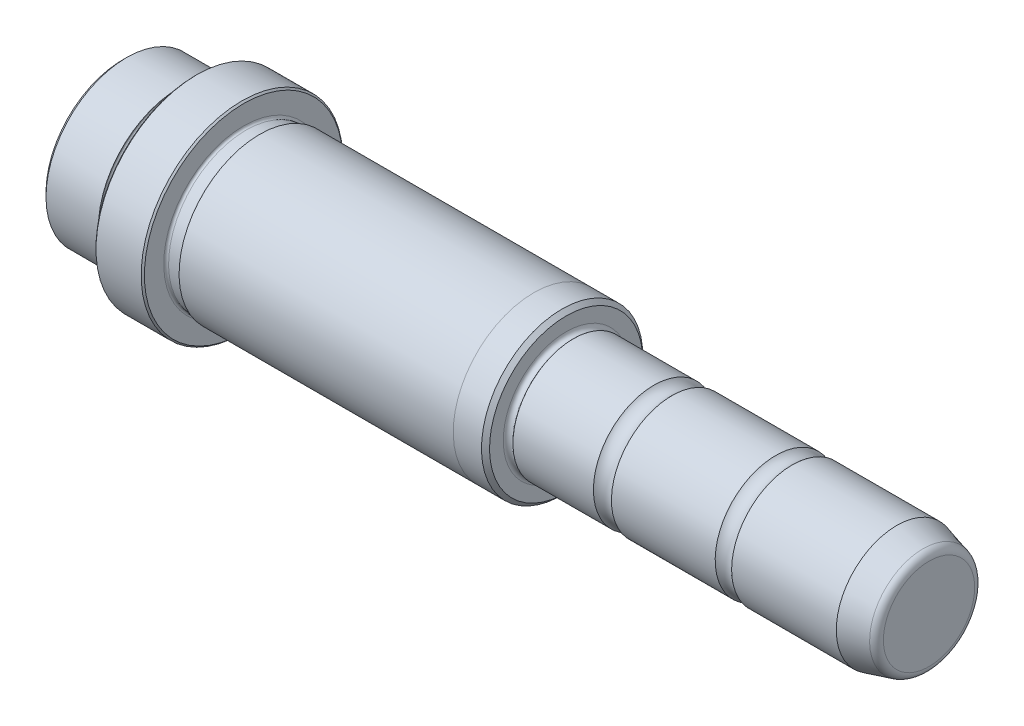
ISO-10303-21;
HEADER;
FILE_DESCRIPTION(('STEP AP214'),'2;1');
FILE_NAME('part.step','',(''),(''),'','','');
FILE_SCHEMA(('AUTOMOTIVE_DESIGN { 1 0 10303 214 1 1 1 1 }'));
ENDSEC;
DATA;
#1=APPLICATION_CONTEXT('core data for automotive mechanical design processes');
#2=APPLICATION_PROTOCOL_DEFINITION('international standard','automotive_design',2000,#1);
#3=PRODUCT_CONTEXT('',#1,'mechanical');
#4=PRODUCT('Part','Part','',(#3));
#5=PRODUCT_RELATED_PRODUCT_CATEGORY('part','',(#4));
#6=PRODUCT_DEFINITION_FORMATION('','',#4);
#7=PRODUCT_DEFINITION_CONTEXT('part definition',#1,'design');
#8=PRODUCT_DEFINITION('design','',#6,#7);
#9=PRODUCT_DEFINITION_SHAPE('','',#8);
#10=(LENGTH_UNIT() NAMED_UNIT(*) SI_UNIT(.MILLI.,.METRE.));
#11=(NAMED_UNIT(*) PLANE_ANGLE_UNIT() SI_UNIT($,.RADIAN.));
#12=(NAMED_UNIT(*) SI_UNIT($,.STERADIAN.) SOLID_ANGLE_UNIT());
#13=UNCERTAINTY_MEASURE_WITH_UNIT(LENGTH_MEASURE(1.E-05),#10,'distance_accuracy_value','');
#14=(GEOMETRIC_REPRESENTATION_CONTEXT(3) GLOBAL_UNCERTAINTY_ASSIGNED_CONTEXT((#13)) GLOBAL_UNIT_ASSIGNED_CONTEXT((#10,
#11,#12)) REPRESENTATION_CONTEXT('',''));
#15=CARTESIAN_POINT('',(0.,0.,0.));
#16=DIRECTION('',(0.,0.,1.));
#17=DIRECTION('',(1.,0.,0.));
#18=AXIS2_PLACEMENT_3D('',#15,#16,#17);
#19=CARTESIAN_POINT('',(45.,0.,0.));
#20=DIRECTION('',(1.,0.,0.));
#21=DIRECTION('',(0.,1.,0.));
#22=AXIS2_PLACEMENT_3D('',#19,#20,#21);
#23=CYLINDRICAL_SURFACE('',#22,7.49999999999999);
#24=CARTESIAN_POINT('',(0.899999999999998,0.,0.));
#25=DIRECTION('',(1.,0.,0.));
#26=DIRECTION('',(0.,1.,0.));
#27=AXIS2_PLACEMENT_3D('',#24,#25,#26);
#28=CIRCLE('',#27,7.49999999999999);
#29=CARTESIAN_POINT('',(0.899999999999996,7.5,0.));
#30=VERTEX_POINT('',#29);
#31=EDGE_CURVE('E105',#30,#30,#28,.T.);
#32=ORIENTED_EDGE('',*,*,#31,.T.);
#33=EDGE_LOOP('',(#32));
#34=FACE_BOUND('',#33,.T.);
#35=CARTESIAN_POINT('',(10.8819660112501,0.,0.));
#36=DIRECTION('',(-1.,0.,0.));
#37=DIRECTION('',(0.,-1.,0.));
#38=AXIS2_PLACEMENT_3D('',#35,#36,#37);
#39=CIRCLE('',#38,7.49999999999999);
#40=CARTESIAN_POINT('',(10.8819660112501,-7.49999999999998,0.));
#41=VERTEX_POINT('',#40);
#42=EDGE_CURVE('E120',#41,#41,#39,.T.);
#43=ORIENTED_EDGE('',*,*,#42,.T.);
#44=EDGE_LOOP('',(#43));
#45=FACE_BOUND('',#44,.T.);
#46=ADVANCED_FACE('F28',(#34,#45),#23,.T.);
#47=CARTESIAN_POINT('',(-55.,9.99999999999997,0.));
#48=DIRECTION('',(-1.,0.,0.));
#49=DIRECTION('',(0.,-1.,0.));
#50=AXIS2_PLACEMENT_3D('',#47,#48,#49);
#51=PLANE('',#50);
#52=CARTESIAN_POINT('',(-55.,0.,0.));
#53=DIRECTION('',(-1.,0.,0.));
#54=DIRECTION('',(0.,-1.,0.));
#55=AXIS2_PLACEMENT_3D('',#52,#53,#54);
#56=CIRCLE('',#55,9.50000000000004);
#57=CARTESIAN_POINT('',(-55.,-9.50000000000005,0.));
#58=VERTEX_POINT('',#57);
#59=EDGE_CURVE('E39',#58,#58,#56,.T.);
#60=ORIENTED_EDGE('',*,*,#59,.T.);
#61=EDGE_LOOP('',(#60));
#62=FACE_BOUND('',#61,.T.);
#63=ADVANCED_FACE('F143',(#62),#51,.T.);
#64=CARTESIAN_POINT('',(45.,0.,0.));
#65=DIRECTION('',(1.,0.,0.));
#66=DIRECTION('',(0.,1.,0.));
#67=AXIS2_PLACEMENT_3D('',#64,#65,#66);
#68=CYLINDRICAL_SURFACE('',#67,9.99999999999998);
#69=CARTESIAN_POINT('',(-54.5,0.,0.));
#70=DIRECTION('',(-1.,0.,0.));
#71=DIRECTION('',(0.,-1.,0.));
#72=AXIS2_PLACEMENT_3D('',#69,#70,#71);
#73=CIRCLE('',#72,9.99999999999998);
#74=CARTESIAN_POINT('',(-54.5,-10.,0.));
#75=VERTEX_POINT('',#74);
#76=EDGE_CURVE('E43',#75,#75,#73,.F.);
#77=ORIENTED_EDGE('',*,*,#76,.T.);
#78=EDGE_LOOP('',(#77));
#79=FACE_BOUND('',#78,.T.);
#80=CARTESIAN_POINT('',(-48.,0.,0.));
#81=DIRECTION('',(1.,0.,0.));
#82=DIRECTION('',(0.,1.,0.));
#83=AXIS2_PLACEMENT_3D('',#80,#81,#82);
#84=CIRCLE('',#83,9.99999999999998);
#85=CARTESIAN_POINT('',(-48.,9.99999999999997,0.));
#86=VERTEX_POINT('',#85);
#87=EDGE_CURVE('E66',#86,#86,#84,.T.);
#88=ORIENTED_EDGE('',*,*,#87,.F.);
#89=EDGE_LOOP('',(#88));
#90=FACE_BOUND('',#89,.T.);
#91=ADVANCED_FACE('F151',(#79,#90),#68,.T.);
#92=CARTESIAN_POINT('',(-48.,9.89999999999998,0.));
#93=DIRECTION('',(1.,0.,0.));
#94=DIRECTION('',(0.,1.,0.));
#95=AXIS2_PLACEMENT_3D('',#92,#93,#94);
#96=PLANE('',#95);
#97=ORIENTED_EDGE('',*,*,#87,.T.);
#98=EDGE_LOOP('',(#97));
#99=FACE_BOUND('',#98,.T.);
#100=CARTESIAN_POINT('',(-48.,0.,0.));
#101=DIRECTION('',(1.,0.,0.));
#102=DIRECTION('',(0.,1.,0.));
#103=AXIS2_PLACEMENT_3D('',#100,#101,#102);
#104=CIRCLE('',#103,9.89999999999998);
#105=CARTESIAN_POINT('',(-48.,9.89999999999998,0.));
#106=VERTEX_POINT('',#105);
#107=EDGE_CURVE('E69',#106,#106,#104,.T.);
#108=ORIENTED_EDGE('',*,*,#107,.F.);
#109=EDGE_LOOP('',(#108));
#110=FACE_BOUND('',#109,.T.);
#111=ADVANCED_FACE('F206',(#99,#110),#96,.T.);
#112=CARTESIAN_POINT('',(-47.7,0.,0.));
#113=DIRECTION('',(1.,0.,0.));
#114=DIRECTION('',(0.,1.,0.));
#115=AXIS2_PLACEMENT_3D('',#112,#113,#114);
#116=TOROIDAL_SURFACE('',#115,9.89999999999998,0.299999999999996);
#117=ORIENTED_EDGE('',*,*,#107,.T.);
#118=EDGE_LOOP('',(#117));
#119=FACE_BOUND('',#118,.T.);
#120=CARTESIAN_POINT('',(-47.7,0.,0.));
#121=DIRECTION('',(1.,0.,0.));
#122=DIRECTION('',(0.,1.,0.));
#123=AXIS2_PLACEMENT_3D('',#120,#121,#122);
#124=CIRCLE('',#123,9.59999999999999);
#125=CARTESIAN_POINT('',(-47.7,9.59999999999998,0.));
#126=VERTEX_POINT('',#125);
#127=EDGE_CURVE('E72',#126,#126,#124,.T.);
#128=ORIENTED_EDGE('',*,*,#127,.F.);
#129=EDGE_LOOP('',(#128));
#130=FACE_BOUND('',#129,.T.);
#131=ADVANCED_FACE('F212',(#119,#130),#116,.F.);
#132=CARTESIAN_POINT('',(45.,0.,0.));
#133=DIRECTION('',(1.,0.,0.));
#134=DIRECTION('',(0.,1.,0.));
#135=AXIS2_PLACEMENT_3D('',#132,#133,#134);
#136=CYLINDRICAL_SURFACE('',#135,9.59999999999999);
#137=ORIENTED_EDGE('',*,*,#127,.T.);
#138=EDGE_LOOP('',(#137));
#139=FACE_BOUND('',#138,.T.);
#140=CARTESIAN_POINT('',(-46.3,0.,0.));
#141=DIRECTION('',(1.,0.,0.));
#142=DIRECTION('',(0.,1.,0.));
#143=AXIS2_PLACEMENT_3D('',#140,#141,#142);
#144=CIRCLE('',#143,9.59999999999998);
#145=CARTESIAN_POINT('',(-46.3,9.59999999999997,0.));
#146=VERTEX_POINT('',#145);
#147=EDGE_CURVE('E75',#146,#146,#144,.T.);
#148=ORIENTED_EDGE('',*,*,#147,.F.);
#149=EDGE_LOOP('',(#148));
#150=FACE_BOUND('',#149,.T.);
#151=ADVANCED_FACE('F218',(#139,#150),#136,.T.);
#152=CARTESIAN_POINT('',(-46.3,0.,0.));
#153=DIRECTION('',(1.,0.,0.));
#154=DIRECTION('',(0.,1.,0.));
#155=AXIS2_PLACEMENT_3D('',#152,#153,#154);
#156=TOROIDAL_SURFACE('',#155,9.89999999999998,0.300000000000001);
#157=ORIENTED_EDGE('',*,*,#147,.T.);
#158=EDGE_LOOP('',(#157));
#159=FACE_BOUND('',#158,.T.);
#160=CARTESIAN_POINT('',(-46.,0.,0.));
#161=DIRECTION('',(1.,0.,0.));
#162=DIRECTION('',(0.,1.,0.));
#163=AXIS2_PLACEMENT_3D('',#160,#161,#162);
#164=CIRCLE('',#163,9.89999999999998);
#165=CARTESIAN_POINT('',(-46.,9.89999999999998,0.));
#166=VERTEX_POINT('',#165);
#167=EDGE_CURVE('E78',#166,#166,#164,.T.);
#168=ORIENTED_EDGE('',*,*,#167,.F.);
#169=EDGE_LOOP('',(#168));
#170=FACE_BOUND('',#169,.T.);
#171=ADVANCED_FACE('F224',(#159,#170),#156,.F.);
#172=CARTESIAN_POINT('',(-46.,12.5,0.));
#173=DIRECTION('',(-1.,0.,0.));
#174=DIRECTION('',(0.,-1.,0.));
#175=AXIS2_PLACEMENT_3D('',#172,#173,#174);
#176=PLANE('',#175);
#177=CARTESIAN_POINT('',(-46.,0.,0.));
#178=DIRECTION('',(-1.,0.,0.));
#179=DIRECTION('',(0.,-1.,0.));
#180=AXIS2_PLACEMENT_3D('',#177,#178,#179);
#181=CIRCLE('',#180,12.3);
#182=CARTESIAN_POINT('',(-46.,12.3,0.));
#183=VERTEX_POINT('',#182);
#184=EDGE_CURVE('E51',#183,#183,#181,.T.);
#185=ORIENTED_EDGE('',*,*,#184,.T.);
#186=EDGE_LOOP('',(#185));
#187=FACE_BOUND('',#186,.T.);
#188=ORIENTED_EDGE('',*,*,#167,.T.);
#189=EDGE_LOOP('',(#188));
#190=FACE_BOUND('',#189,.T.);
#191=ADVANCED_FACE('F230',(#187,#190),#176,.T.);
#192=CARTESIAN_POINT('',(45.,0.,0.));
#193=DIRECTION('',(1.,0.,0.));
#194=DIRECTION('',(0.,1.,0.));
#195=AXIS2_PLACEMENT_3D('',#192,#193,#194);
#196=CYLINDRICAL_SURFACE('',#195,12.5);
#197=CARTESIAN_POINT('',(-45.8,0.,0.));
#198=DIRECTION('',(-1.,0.,0.));
#199=DIRECTION('',(0.,-1.,0.));
#200=AXIS2_PLACEMENT_3D('',#197,#198,#199);
#201=CIRCLE('',#200,12.5);
#202=CARTESIAN_POINT('',(-45.8,12.5,0.));
#203=VERTEX_POINT('',#202);
#204=EDGE_CURVE('E54',#203,#203,#201,.F.);
#205=CARTESIAN_POINT('',(-40.2,0.,0.));
#206=DIRECTION('',(1.,0.,0.));
#207=DIRECTION('',(0.,1.,0.));
#208=AXIS2_PLACEMENT_3D('',#205,#206,#207);
#209=CIRCLE('',#208,12.5);
#210=CARTESIAN_POINT('',(-40.2,12.5,0.));
#211=VERTEX_POINT('',#210);
#212=EDGE_CURVE('E57',#211,#211,#209,.F.);
#213=CARTESIAN_POINT('',(-45.8,12.5,0.));
#214=CARTESIAN_POINT('',(-45.7416666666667,12.5,0.));
#215=CARTESIAN_POINT('',(-45.6833333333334,12.5,0.));
#216=CARTESIAN_POINT('',(-45.5666666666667,12.5,0.));
#217=CARTESIAN_POINT('',(-45.5083333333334,12.5,0.));
#218=CARTESIAN_POINT('',(-45.3916666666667,12.5,0.));
#219=CARTESIAN_POINT('',(-45.3333333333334,12.5,0.));
#220=CARTESIAN_POINT('',(-45.2166666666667,12.5,0.));
#221=CARTESIAN_POINT('',(-45.1583333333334,12.5,0.));
#222=CARTESIAN_POINT('',(-45.0416666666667,12.5,0.));
#223=CARTESIAN_POINT('',(-44.9833333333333,12.5,0.));
#224=CARTESIAN_POINT('',(-44.8666666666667,12.5,0.));
#225=CARTESIAN_POINT('',(-44.8083333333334,12.5,0.));
#226=CARTESIAN_POINT('',(-44.6916666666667,12.5,0.));
#227=CARTESIAN_POINT('',(-44.6333333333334,12.5,0.));
#228=CARTESIAN_POINT('',(-44.5166666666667,12.5,0.));
#229=CARTESIAN_POINT('',(-44.4583333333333,12.5,0.));
#230=CARTESIAN_POINT('',(-44.3416666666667,12.5,0.));
#231=CARTESIAN_POINT('',(-44.2833333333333,12.5,0.));
#232=CARTESIAN_POINT('',(-44.1666666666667,12.5,0.));
#233=CARTESIAN_POINT('',(-44.1083333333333,12.5,0.));
#234=CARTESIAN_POINT('',(-43.9916666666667,12.5,0.));
#235=CARTESIAN_POINT('',(-43.9333333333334,12.5,0.));
#236=CARTESIAN_POINT('',(-43.8166666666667,12.5,0.));
#237=CARTESIAN_POINT('',(-43.7583333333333,12.5,0.));
#238=CARTESIAN_POINT('',(-43.6416666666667,12.5,0.));
#239=CARTESIAN_POINT('',(-43.5833333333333,12.5,0.));
#240=CARTESIAN_POINT('',(-43.4666666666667,12.5,0.));
#241=CARTESIAN_POINT('',(-43.4083333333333,12.5,0.));
#242=CARTESIAN_POINT('',(-43.2916666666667,12.5,0.));
#243=CARTESIAN_POINT('',(-43.2333333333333,12.5,0.));
#244=CARTESIAN_POINT('',(-43.1166666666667,12.5,0.));
#245=CARTESIAN_POINT('',(-43.0583333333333,12.5,0.));
#246=CARTESIAN_POINT('',(-42.9416666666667,12.5,0.));
#247=CARTESIAN_POINT('',(-42.8833333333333,12.5,0.));
#248=CARTESIAN_POINT('',(-42.7666666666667,12.5,0.));
#249=CARTESIAN_POINT('',(-42.7083333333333,12.5,0.));
#250=CARTESIAN_POINT('',(-42.5916666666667,12.5,0.));
#251=CARTESIAN_POINT('',(-42.5333333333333,12.5,0.));
#252=CARTESIAN_POINT('',(-42.4166666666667,12.5,0.));
#253=CARTESIAN_POINT('',(-42.3583333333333,12.5,0.));
#254=CARTESIAN_POINT('',(-42.2416666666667,12.5,0.));
#255=CARTESIAN_POINT('',(-42.1833333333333,12.5,0.));
#256=CARTESIAN_POINT('',(-42.0666666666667,12.5,0.));
#257=CARTESIAN_POINT('',(-42.0083333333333,12.5,0.));
#258=CARTESIAN_POINT('',(-41.8916666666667,12.5,0.));
#259=CARTESIAN_POINT('',(-41.8333333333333,12.5,0.));
#260=CARTESIAN_POINT('',(-41.7166666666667,12.5,0.));
#261=CARTESIAN_POINT('',(-41.6583333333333,12.5,0.));
#262=CARTESIAN_POINT('',(-41.5416666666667,12.5,0.));
#263=CARTESIAN_POINT('',(-41.4833333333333,12.5,0.));
#264=CARTESIAN_POINT('',(-41.3666666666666,12.5,0.));
#265=CARTESIAN_POINT('',(-41.3083333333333,12.5,0.));
#266=CARTESIAN_POINT('',(-41.1916666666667,12.5,0.));
#267=CARTESIAN_POINT('',(-41.1333333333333,12.5,0.));
#268=CARTESIAN_POINT('',(-41.0166666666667,12.5,0.));
#269=CARTESIAN_POINT('',(-40.9583333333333,12.5,0.));
#270=CARTESIAN_POINT('',(-40.8416666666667,12.5,0.));
#271=CARTESIAN_POINT('',(-40.7833333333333,12.5,0.));
#272=CARTESIAN_POINT('',(-40.6666666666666,12.5,0.));
#273=CARTESIAN_POINT('',(-40.6083333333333,12.5,0.));
#274=CARTESIAN_POINT('',(-40.4916666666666,12.5,0.));
#275=CARTESIAN_POINT('',(-40.4333333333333,12.5,0.));
#276=CARTESIAN_POINT('',(-40.3166666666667,12.5,0.));
#277=CARTESIAN_POINT('',(-40.2583333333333,12.5,0.));
#278=CARTESIAN_POINT('',(-40.2,12.5,0.));
#279=B_SPLINE_CURVE_WITH_KNOTS('',3,(#213,#214,#215,#216,#217,#218,#219,#220,#221,#222,#223,
#224,#225,#226,#227,#228,#229,#230,#231,#232,#233,#234,#235,#236,#237,#238,#239,#240,#241,#242,
#243,#244,#245,#246,#247,#248,#249,#250,#251,#252,#253,#254,#255,#256,#257,#258,#259,#260,#261,
#262,#263,#264,#265,#266,#267,#268,#269,#270,#271,#272,#273,#274,#275,#276,#277,#278),
.UNSPECIFIED.,.F.,.F.,(4,2,2,2,2,2,2,2,2,2,2,2,2,2,2,2,2,2,2,2,2,2,2,2,2,2,2,2,2,2,2,2,4),(0.,
0.175000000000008,0.350000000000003,0.524999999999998,0.700000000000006,0.875000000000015,
1.05000000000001,1.225,1.40000000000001,1.57500000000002,1.75000000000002,1.92500000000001,
2.10000000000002,2.27500000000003,2.45000000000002,2.62500000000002,2.80000000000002,
2.97500000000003,3.15000000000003,3.32500000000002,3.50000000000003,3.67500000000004,
3.85000000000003,4.02500000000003,4.20000000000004,4.37500000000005,4.55000000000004,
4.72500000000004,4.90000000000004,5.07500000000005,5.25000000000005,5.42500000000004,
5.60000000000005),.UNSPECIFIED.);
#280=EDGE_CURVE('BSEAM235',#203,#211,#279,.T.);
#281=ORIENTED_EDGE('',*,*,#204,.T.);
#282=ORIENTED_EDGE('',*,*,#212,.T.);
#283=ORIENTED_EDGE('',*,*,#280,.T.);
#284=ORIENTED_EDGE('',*,*,#280,.F.);
#285=EDGE_LOOP('',(#281,#283,#282,#284));
#286=FACE_BOUND('',#285,.T.);
#287=ADVANCED_FACE('F235',(#286),#196,.T.);
#288=CARTESIAN_POINT('',(-40.,9.89999999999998,0.));
#289=DIRECTION('',(1.,0.,0.));
#290=DIRECTION('',(0.,1.,0.));
#291=AXIS2_PLACEMENT_3D('',#288,#289,#290);
#292=PLANE('',#291);
#293=CARTESIAN_POINT('',(-40.,0.,0.));
#294=DIRECTION('',(1.,0.,0.));
#295=DIRECTION('',(0.,1.,0.));
#296=AXIS2_PLACEMENT_3D('',#293,#294,#295);
#297=CIRCLE('',#296,12.3);
#298=CARTESIAN_POINT('',(-40.,12.3,0.));
#299=VERTEX_POINT('',#298);
#300=EDGE_CURVE('E48',#299,#299,#297,.T.);
#301=ORIENTED_EDGE('',*,*,#300,.T.);
#302=EDGE_LOOP('',(#301));
#303=FACE_BOUND('',#302,.T.);
#304=CARTESIAN_POINT('',(-40.,0.,0.));
#305=DIRECTION('',(1.,0.,0.));
#306=DIRECTION('',(0.,1.,0.));
#307=AXIS2_PLACEMENT_3D('',#304,#305,#306);
#308=CIRCLE('',#307,9.89999999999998);
#309=CARTESIAN_POINT('',(-40.,9.89999999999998,0.));
#310=VERTEX_POINT('',#309);
#311=EDGE_CURVE('E81',#310,#310,#308,.T.);
#312=ORIENTED_EDGE('',*,*,#311,.F.);
#313=EDGE_LOOP('',(#312));
#314=FACE_BOUND('',#313,.T.);
#315=ADVANCED_FACE('F241',(#303,#314),#292,.T.);
#316=CARTESIAN_POINT('',(-39.7,0.,0.));
#317=DIRECTION('',(1.,0.,0.));
#318=DIRECTION('',(0.,1.,0.));
#319=AXIS2_PLACEMENT_3D('',#316,#317,#318);
#320=TOROIDAL_SURFACE('',#319,9.89999999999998,0.299999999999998);
#321=ORIENTED_EDGE('',*,*,#311,.T.);
#322=EDGE_LOOP('',(#321));
#323=FACE_BOUND('',#322,.T.);
#324=CARTESIAN_POINT('',(-39.7,0.,0.));
#325=DIRECTION('',(1.,0.,0.));
#326=DIRECTION('',(0.,1.,0.));
#327=AXIS2_PLACEMENT_3D('',#324,#325,#326);
#328=CIRCLE('',#327,9.59999999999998);
#329=CARTESIAN_POINT('',(-39.7,9.59999999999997,0.));
#330=VERTEX_POINT('',#329);
#331=EDGE_CURVE('E84',#330,#330,#328,.T.);
#332=ORIENTED_EDGE('',*,*,#331,.F.);
#333=EDGE_LOOP('',(#332));
#334=FACE_BOUND('',#333,.T.);
#335=ADVANCED_FACE('F247',(#323,#334),#320,.F.);
#336=CARTESIAN_POINT('',(45.,0.,0.));
#337=DIRECTION('',(1.,0.,0.));
#338=DIRECTION('',(0.,1.,0.));
#339=AXIS2_PLACEMENT_3D('',#336,#337,#338);
#340=CYLINDRICAL_SURFACE('',#339,9.59999999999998);
#341=ORIENTED_EDGE('',*,*,#331,.T.);
#342=EDGE_LOOP('',(#341));
#343=FACE_BOUND('',#342,.T.);
#344=CARTESIAN_POINT('',(-38.3,0.,0.));
#345=DIRECTION('',(1.,0.,0.));
#346=DIRECTION('',(0.,1.,0.));
#347=AXIS2_PLACEMENT_3D('',#344,#345,#346);
#348=CIRCLE('',#347,9.59999999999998);
#349=CARTESIAN_POINT('',(-38.3,9.59999999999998,0.));
#350=VERTEX_POINT('',#349);
#351=EDGE_CURVE('E87',#350,#350,#348,.T.);
#352=ORIENTED_EDGE('',*,*,#351,.F.);
#353=EDGE_LOOP('',(#352));
#354=FACE_BOUND('',#353,.T.);
#355=ADVANCED_FACE('F251',(#343,#354),#340,.T.);
#356=CARTESIAN_POINT('',(-38.3,0.,0.));
#357=DIRECTION('',(1.,0.,0.));
#358=DIRECTION('',(0.,1.,0.));
#359=AXIS2_PLACEMENT_3D('',#356,#357,#358);
#360=TOROIDAL_SURFACE('',#359,9.89999999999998,0.300000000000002);
#361=ORIENTED_EDGE('',*,*,#351,.T.);
#362=EDGE_LOOP('',(#361));
#363=FACE_BOUND('',#362,.T.);
#364=CARTESIAN_POINT('',(-38.,0.,0.));
#365=DIRECTION('',(1.,0.,0.));
#366=DIRECTION('',(0.,1.,0.));
#367=AXIS2_PLACEMENT_3D('',#364,#365,#366);
#368=CIRCLE('',#367,9.89999999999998);
#369=CARTESIAN_POINT('',(-38.,9.89999999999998,0.));
#370=VERTEX_POINT('',#369);
#371=EDGE_CURVE('E90',#370,#370,#368,.T.);
#372=ORIENTED_EDGE('',*,*,#371,.F.);
#373=EDGE_LOOP('',(#372));
#374=FACE_BOUND('',#373,.T.);
#375=ADVANCED_FACE('F255',(#363,#374),#360,.F.);
#376=CARTESIAN_POINT('',(-38.,10.0001,0.));
#377=DIRECTION('',(-1.,0.,0.));
#378=DIRECTION('',(0.,-1.,0.));
#379=AXIS2_PLACEMENT_3D('',#376,#377,#378);
#380=PLANE('',#379);
#381=ORIENTED_EDGE('',*,*,#371,.T.);
#382=EDGE_LOOP('',(#381));
#383=FACE_BOUND('',#382,.T.);
#384=CARTESIAN_POINT('',(-38.,0.,0.));
#385=DIRECTION('',(1.,0.,0.));
#386=DIRECTION('',(0.,1.,0.));
#387=AXIS2_PLACEMENT_3D('',#384,#385,#386);
#388=CIRCLE('',#387,10.0001);
#389=CARTESIAN_POINT('',(-38.,10.0001,0.));
#390=VERTEX_POINT('',#389);
#391=EDGE_CURVE('E93',#390,#390,#388,.T.);
#392=ORIENTED_EDGE('',*,*,#391,.F.);
#393=EDGE_LOOP('',(#392));
#394=FACE_BOUND('',#393,.T.);
#395=ADVANCED_FACE('F259',(#383,#394),#380,.T.);
#396=CARTESIAN_POINT('',(45.,0.,0.));
#397=DIRECTION('',(1.,0.,0.));
#398=DIRECTION('',(0.,1.,0.));
#399=AXIS2_PLACEMENT_3D('',#396,#397,#398);
#400=CYLINDRICAL_SURFACE('',#399,10.0001);
#401=ORIENTED_EDGE('',*,*,#391,.T.);
#402=EDGE_LOOP('',(#401));
#403=FACE_BOUND('',#402,.T.);
#404=CARTESIAN_POINT('',(-4.,0.,0.));
#405=DIRECTION('',(1.,0.,0.));
#406=DIRECTION('',(0.,1.,0.));
#407=AXIS2_PLACEMENT_3D('',#404,#405,#406);
#408=CIRCLE('',#407,10.0001);
#409=CARTESIAN_POINT('',(-4.00000000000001,10.0001,0.));
#410=VERTEX_POINT('',#409);
#411=EDGE_CURVE('E96',#410,#410,#408,.T.);
#412=ORIENTED_EDGE('',*,*,#411,.F.);
#413=EDGE_LOOP('',(#412));
#414=FACE_BOUND('',#413,.T.);
#415=ADVANCED_FACE('F263',(#403,#414),#400,.T.);
#416=CARTESIAN_POINT('',(-4.,10.0001,0.));
#417=DIRECTION('',(1.,0.,0.));
#418=DIRECTION('',(0.,1.,0.));
#419=AXIS2_PLACEMENT_3D('',#416,#417,#418);
#420=PLANE('',#419);
#421=ORIENTED_EDGE('',*,*,#411,.T.);
#422=EDGE_LOOP('',(#421));
#423=FACE_BOUND('',#422,.T.);
#424=CARTESIAN_POINT('',(-4.,0.,0.));
#425=DIRECTION('',(1.,0.,0.));
#426=DIRECTION('',(0.,1.,0.));
#427=AXIS2_PLACEMENT_3D('',#424,#425,#426);
#428=CIRCLE('',#427,9.99999999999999);
#429=CARTESIAN_POINT('',(-4.00000000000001,10.,0.));
#430=VERTEX_POINT('',#429);
#431=EDGE_CURVE('E99',#430,#430,#428,.T.);
#432=ORIENTED_EDGE('',*,*,#431,.F.);
#433=EDGE_LOOP('',(#432));
#434=FACE_BOUND('',#433,.T.);
#435=ADVANCED_FACE('F267',(#423,#434),#420,.T.);
#436=CARTESIAN_POINT('',(45.,0.,0.));
#437=DIRECTION('',(1.,0.,0.));
#438=DIRECTION('',(0.,1.,0.));
#439=AXIS2_PLACEMENT_3D('',#436,#437,#438);
#440=CYLINDRICAL_SURFACE('',#439,9.99999999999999);
#441=CARTESIAN_POINT('',(-0.500000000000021,0.,0.));
#442=DIRECTION('',(1.,0.,0.));
#443=DIRECTION('',(0.,1.,0.));
#444=AXIS2_PLACEMENT_3D('',#441,#442,#443);
#445=CIRCLE('',#444,9.99999999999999);
#446=CARTESIAN_POINT('',(-0.500000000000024,9.99999999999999,0.));
#447=VERTEX_POINT('',#446);
#448=EDGE_CURVE('E10',#447,#447,#445,.F.);
#449=ORIENTED_EDGE('',*,*,#448,.T.);
#450=EDGE_LOOP('',(#449));
#451=FACE_BOUND('',#450,.T.);
#452=ORIENTED_EDGE('',*,*,#431,.T.);
#453=EDGE_LOOP('',(#452));
#454=FACE_BOUND('',#453,.T.);
#455=ADVANCED_FACE('F271',(#451,#454),#440,.T.);
#456=CARTESIAN_POINT('',(0.,7.79999999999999,0.));
#457=DIRECTION('',(1.,0.,0.));
#458=DIRECTION('',(0.,1.,0.));
#459=AXIS2_PLACEMENT_3D('',#456,#457,#458);
#460=PLANE('',#459);
#461=CARTESIAN_POINT('',(0.,0.,0.));
#462=DIRECTION('',(1.,0.,0.));
#463=DIRECTION('',(0.,1.,0.));
#464=AXIS2_PLACEMENT_3D('',#461,#462,#463);
#465=CIRCLE('',#464,9.49999999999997);
#466=CARTESIAN_POINT('',(0.,9.49999999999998,0.));
#467=VERTEX_POINT('',#466);
#468=EDGE_CURVE('E35',#467,#467,#465,.T.);
#469=ORIENTED_EDGE('',*,*,#468,.T.);
#470=EDGE_LOOP('',(#469));
#471=FACE_BOUND('',#470,.T.);
#472=CARTESIAN_POINT('',(0.,0.,0.));
#473=DIRECTION('',(1.,0.,0.));
#474=DIRECTION('',(0.,1.,0.));
#475=AXIS2_PLACEMENT_3D('',#472,#473,#474);
#476=CIRCLE('',#475,7.79999999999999);
#477=CARTESIAN_POINT('',(0.,7.8,0.));
#478=VERTEX_POINT('',#477);
#479=EDGE_CURVE('E102',#478,#478,#476,.T.);
#480=ORIENTED_EDGE('',*,*,#479,.F.);
#481=EDGE_LOOP('',(#480));
#482=FACE_BOUND('',#481,.T.);
#483=ADVANCED_FACE('F138',(#471,#482),#460,.T.);
#484=CARTESIAN_POINT('',(0.5,0.,0.));
#485=DIRECTION('',(1.,0.,0.));
#486=DIRECTION('',(0.,1.,0.));
#487=AXIS2_PLACEMENT_3D('',#484,#485,#486);
#488=TOROIDAL_SURFACE('',#487,7.79999999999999,0.5);
#489=ORIENTED_EDGE('',*,*,#479,.T.);
#490=EDGE_LOOP('',(#489));
#491=FACE_BOUND('',#490,.T.);
#492=ORIENTED_EDGE('',*,*,#31,.F.);
#493=EDGE_LOOP('',(#492));
#494=FACE_BOUND('',#493,.T.);
#495=ADVANCED_FACE('F128',(#491,#494),#488,.F.);
#496=CARTESIAN_POINT('',(12.,0.,0.));
#497=DIRECTION('',(-1.,0.,0.));
#498=DIRECTION('',(0.,-1.,0.));
#499=AXIS2_PLACEMENT_3D('',#496,#497,#498);
#500=TOROIDAL_SURFACE('',#499,8.49999999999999,1.5);
#501=CARTESIAN_POINT('',(13.1180339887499,0.,0.));
#502=DIRECTION('',(-1.,0.,0.));
#503=DIRECTION('',(0.,-1.,0.));
#504=AXIS2_PLACEMENT_3D('',#501,#502,#503);
#505=CIRCLE('',#504,7.49999999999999);
#506=CARTESIAN_POINT('',(13.1180339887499,-7.49999999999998,0.));
#507=VERTEX_POINT('',#506);
#508=EDGE_CURVE('E117',#507,#507,#505,.T.);
#509=ORIENTED_EDGE('',*,*,#508,.T.);
#510=EDGE_LOOP('',(#509));
#511=FACE_BOUND('',#510,.T.);
#512=ORIENTED_EDGE('',*,*,#42,.F.);
#513=EDGE_LOOP('',(#512));
#514=FACE_BOUND('',#513,.T.);
#515=ADVANCED_FACE('F125',(#511,#514),#500,.F.);
#516=CARTESIAN_POINT('',(45.,6.42820323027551,0.));
#517=DIRECTION('',(1.,0.,0.));
#518=DIRECTION('',(0.,1.,0.));
#519=AXIS2_PLACEMENT_3D('',#516,#517,#518);
#520=PLANE('',#519);
#521=CARTESIAN_POINT('',(45.,0.,0.));
#522=DIRECTION('',(1.,0.,0.));
#523=DIRECTION('',(0.,1.,0.));
#524=AXIS2_PLACEMENT_3D('',#521,#522,#523);
#525=CIRCLE('',#524,5.66087624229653);
#526=CARTESIAN_POINT('',(45.,5.66087624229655,0.));
#527=VERTEX_POINT('',#526);
#528=EDGE_CURVE('E63',#527,#527,#525,.T.);
#529=ORIENTED_EDGE('',*,*,#528,.T.);
#530=EDGE_LOOP('',(#529));
#531=FACE_BOUND('',#530,.T.);
#532=ADVANCED_FACE('F127',(#531),#520,.T.);
#533=CARTESIAN_POINT('',(45.,0.,0.));
#534=DIRECTION('',(-1.,0.,0.));
#535=DIRECTION('',(0.,-1.,0.));
#536=AXIS2_PLACEMENT_3D('',#533,#534,#535);
#537=CONICAL_SURFACE('',#536,6.42820323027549,0.26179938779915);
#538=CARTESIAN_POINT('',(44.2588190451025,0.,0.));
#539=DIRECTION('',(1.,0.,0.));
#540=DIRECTION('',(0.,1.,0.));
#541=AXIS2_PLACEMENT_3D('',#538,#539,#540);
#542=CIRCLE('',#541,6.6268020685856);
#543=CARTESIAN_POINT('',(44.2588190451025,6.62680206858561,0.));
#544=VERTEX_POINT('',#543);
#545=EDGE_CURVE('E60',#544,#544,#542,.F.);
#546=ORIENTED_EDGE('',*,*,#545,.T.);
#547=EDGE_LOOP('',(#546));
#548=FACE_BOUND('',#547,.T.);
#549=CARTESIAN_POINT('',(41.,0.,0.));
#550=DIRECTION('',(1.,0.,0.));
#551=DIRECTION('',(0.,1.,0.));
#552=AXIS2_PLACEMENT_3D('',#549,#550,#551);
#553=CIRCLE('',#552,7.49999999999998);
#554=CARTESIAN_POINT('',(41.,7.5,0.));
#555=VERTEX_POINT('',#554);
#556=EDGE_CURVE('E108',#555,#555,#553,.T.);
#557=ORIENTED_EDGE('',*,*,#556,.T.);
#558=EDGE_LOOP('',(#557));
#559=FACE_BOUND('',#558,.T.);
#560=ADVANCED_FACE('F135',(#548,#559),#537,.T.);
#561=ORIENTED_EDGE('',*,*,#556,.F.);
#562=EDGE_LOOP('',(#561));
#563=FACE_BOUND('',#562,.T.);
#564=CARTESIAN_POINT('',(28.0198039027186,0.,0.));
#565=DIRECTION('',(-1.,0.,0.));
#566=DIRECTION('',(0.,-1.,0.));
#567=AXIS2_PLACEMENT_3D('',#564,#565,#566);
#568=CIRCLE('',#567,7.49999999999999);
#569=CARTESIAN_POINT('',(28.0198039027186,-7.49999999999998,0.));
#570=VERTEX_POINT('',#569);
#571=EDGE_CURVE('E111',#570,#570,#568,.T.);
#572=ORIENTED_EDGE('',*,*,#571,.F.);
#573=EDGE_LOOP('',(#572));
#574=FACE_BOUND('',#573,.T.);
#575=ADVANCED_FACE('F147',(#563,#574),#23,.T.);
#576=CARTESIAN_POINT('',(27.,0.,0.));
#577=DIRECTION('',(-1.,0.,0.));
#578=DIRECTION('',(0.,-1.,0.));
#579=AXIS2_PLACEMENT_3D('',#576,#577,#578);
#580=TOROIDAL_SURFACE('',#579,8.59999999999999,1.5);
#581=ORIENTED_EDGE('',*,*,#571,.T.);
#582=EDGE_LOOP('',(#581));
#583=FACE_BOUND('',#582,.T.);
#584=CARTESIAN_POINT('',(25.9801960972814,0.,0.));
#585=DIRECTION('',(-1.,0.,0.));
#586=DIRECTION('',(0.,-1.,0.));
#587=AXIS2_PLACEMENT_3D('',#584,#585,#586);
#588=CIRCLE('',#587,7.49999999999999);
#589=CARTESIAN_POINT('',(25.9801960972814,-7.49999999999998,0.));
#590=VERTEX_POINT('',#589);
#591=EDGE_CURVE('E114',#590,#590,#588,.T.);
#592=ORIENTED_EDGE('',*,*,#591,.F.);
#593=EDGE_LOOP('',(#592));
#594=FACE_BOUND('',#593,.T.);
#595=ADVANCED_FACE('F157',(#583,#594),#580,.F.);
#596=ORIENTED_EDGE('',*,*,#591,.T.);
#597=EDGE_LOOP('',(#596));
#598=FACE_BOUND('',#597,.T.);
#599=ORIENTED_EDGE('',*,*,#508,.F.);
#600=EDGE_LOOP('',(#599));
#601=FACE_BOUND('',#600,.T.);
#602=ADVANCED_FACE('F146',(#598,#601),#23,.T.);
#603=CARTESIAN_POINT('',(44.,0.,0.));
#604=DIRECTION('',(1.,0.,0.));
#605=DIRECTION('',(0.,1.,0.));
#606=AXIS2_PLACEMENT_3D('',#603,#604,#605);
#607=TOROIDAL_SURFACE('',#606,5.66087624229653,1.);
#608=ORIENTED_EDGE('',*,*,#545,.F.);
#609=EDGE_LOOP('',(#608));
#610=FACE_BOUND('',#609,.T.);
#611=ORIENTED_EDGE('',*,*,#528,.F.);
#612=EDGE_LOOP('',(#611));
#613=FACE_BOUND('',#612,.T.);
#614=ADVANCED_FACE('F156',(#610,#613),#607,.T.);
#615=CARTESIAN_POINT('',(-45.8,0.,0.));
#616=DIRECTION('',(1.,0.,0.));
#617=DIRECTION('',(0.,1.,0.));
#618=AXIS2_PLACEMENT_3D('',#615,#616,#617);
#619=CONICAL_SURFACE('',#618,12.5,0.78539816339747);
#620=CARTESIAN_POINT('',(-46.,12.3,0.));
#621=CARTESIAN_POINT('',(-45.9979166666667,12.3020833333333,0.));
#622=CARTESIAN_POINT('',(-45.9958333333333,12.3041666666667,0.));
#623=CARTESIAN_POINT('',(-45.9916666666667,12.3083333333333,0.));
#624=CARTESIAN_POINT('',(-45.9895833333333,12.3104166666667,0.));
#625=CARTESIAN_POINT('',(-45.9854166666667,12.3145833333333,0.));
#626=CARTESIAN_POINT('',(-45.9833333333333,12.3166666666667,0.));
#627=CARTESIAN_POINT('',(-45.9791666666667,12.3208333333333,0.));
#628=CARTESIAN_POINT('',(-45.9770833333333,12.3229166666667,0.));
#629=CARTESIAN_POINT('',(-45.9729166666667,12.3270833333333,0.));
#630=CARTESIAN_POINT('',(-45.9708333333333,12.3291666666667,0.));
#631=CARTESIAN_POINT('',(-45.9666666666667,12.3333333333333,0.));
#632=CARTESIAN_POINT('',(-45.9645833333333,12.3354166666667,0.));
#633=CARTESIAN_POINT('',(-45.9604166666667,12.3395833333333,0.));
#634=CARTESIAN_POINT('',(-45.9583333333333,12.3416666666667,0.));
#635=CARTESIAN_POINT('',(-45.9541666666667,12.3458333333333,0.));
#636=CARTESIAN_POINT('',(-45.9520833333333,12.3479166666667,0.));
#637=CARTESIAN_POINT('',(-45.9479166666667,12.3520833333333,0.));
#638=CARTESIAN_POINT('',(-45.9458333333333,12.3541666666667,0.));
#639=CARTESIAN_POINT('',(-45.9416666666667,12.3583333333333,0.));
#640=CARTESIAN_POINT('',(-45.9395833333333,12.3604166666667,0.));
#641=CARTESIAN_POINT('',(-45.9354166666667,12.3645833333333,0.));
#642=CARTESIAN_POINT('',(-45.9333333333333,12.3666666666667,0.));
#643=CARTESIAN_POINT('',(-45.9291666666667,12.3708333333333,0.));
#644=CARTESIAN_POINT('',(-45.9270833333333,12.3729166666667,0.));
#645=CARTESIAN_POINT('',(-45.9229166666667,12.3770833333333,0.));
#646=CARTESIAN_POINT('',(-45.9208333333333,12.3791666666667,0.));
#647=CARTESIAN_POINT('',(-45.9166666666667,12.3833333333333,0.));
#648=CARTESIAN_POINT('',(-45.9145833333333,12.3854166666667,0.));
#649=CARTESIAN_POINT('',(-45.9104166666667,12.3895833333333,0.));
#650=CARTESIAN_POINT('',(-45.9083333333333,12.3916666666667,0.));
#651=CARTESIAN_POINT('',(-45.9041666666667,12.3958333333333,0.));
#652=CARTESIAN_POINT('',(-45.9020833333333,12.3979166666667,0.));
#653=CARTESIAN_POINT('',(-45.8979166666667,12.4020833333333,0.));
#654=CARTESIAN_POINT('',(-45.8958333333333,12.4041666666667,0.));
#655=CARTESIAN_POINT('',(-45.8916666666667,12.4083333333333,0.));
#656=CARTESIAN_POINT('',(-45.8895833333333,12.4104166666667,0.));
#657=CARTESIAN_POINT('',(-45.8854166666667,12.4145833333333,0.));
#658=CARTESIAN_POINT('',(-45.8833333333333,12.4166666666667,0.));
#659=CARTESIAN_POINT('',(-45.8791666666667,12.4208333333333,0.));
#660=CARTESIAN_POINT('',(-45.8770833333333,12.4229166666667,0.));
#661=CARTESIAN_POINT('',(-45.8729166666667,12.4270833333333,0.));
#662=CARTESIAN_POINT('',(-45.8708333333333,12.4291666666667,0.));
#663=CARTESIAN_POINT('',(-45.8666666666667,12.4333333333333,0.));
#664=CARTESIAN_POINT('',(-45.8645833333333,12.4354166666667,0.));
#665=CARTESIAN_POINT('',(-45.8604166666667,12.4395833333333,0.));
#666=CARTESIAN_POINT('',(-45.8583333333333,12.4416666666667,0.));
#667=CARTESIAN_POINT('',(-45.8541666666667,12.4458333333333,0.));
#668=CARTESIAN_POINT('',(-45.8520833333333,12.4479166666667,0.));
#669=CARTESIAN_POINT('',(-45.8479166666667,12.4520833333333,0.));
#670=CARTESIAN_POINT('',(-45.8458333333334,12.4541666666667,0.));
#671=CARTESIAN_POINT('',(-45.8416666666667,12.4583333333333,0.));
#672=CARTESIAN_POINT('',(-45.8395833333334,12.4604166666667,0.));
#673=CARTESIAN_POINT('',(-45.8354166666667,12.4645833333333,0.));
#674=CARTESIAN_POINT('',(-45.8333333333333,12.4666666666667,0.));
#675=CARTESIAN_POINT('',(-45.8291666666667,12.4708333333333,0.));
#676=CARTESIAN_POINT('',(-45.8270833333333,12.4729166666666,0.));
#677=CARTESIAN_POINT('',(-45.8229166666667,12.4770833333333,0.));
#678=CARTESIAN_POINT('',(-45.8208333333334,12.4791666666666,0.));
#679=CARTESIAN_POINT('',(-45.8166666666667,12.4833333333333,0.));
#680=CARTESIAN_POINT('',(-45.8145833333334,12.4854166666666,0.));
#681=CARTESIAN_POINT('',(-45.8104166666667,12.4895833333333,0.));
#682=CARTESIAN_POINT('',(-45.8083333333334,12.4916666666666,0.));
#683=CARTESIAN_POINT('',(-45.8041666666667,12.4958333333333,0.));
#684=CARTESIAN_POINT('',(-45.8020833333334,12.4979166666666,0.));
#685=CARTESIAN_POINT('',(-45.8,12.5,0.));
#686=B_SPLINE_CURVE_WITH_KNOTS('',3,(#620,#621,#622,#623,#624,#625,#626,#627,#628,#629,#630,
#631,#632,#633,#634,#635,#636,#637,#638,#639,#640,#641,#642,#643,#644,#645,#646,#647,#648,#649,
#650,#651,#652,#653,#654,#655,#656,#657,#658,#659,#660,#661,#662,#663,#664,#665,#666,#667,#668,
#669,#670,#671,#672,#673,#674,#675,#676,#677,#678,#679,#680,#681,#682,#683,#684,#685),
.UNSPECIFIED.,.F.,.F.,(4,2,2,2,2,2,2,2,2,2,2,2,2,2,2,2,2,2,2,2,2,2,2,2,2,2,2,2,2,2,2,2,4),(0.,
0.00883883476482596,0.0176776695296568,0.0265165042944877,0.0353553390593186,0.0441941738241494,
0.0530330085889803,0.0618718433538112,0.070710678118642,0.0795495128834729,0.0883883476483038,
0.0972271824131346,0.106066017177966,0.114904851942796,0.123743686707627,0.132582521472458,
0.14142135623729,0.150260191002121,0.159099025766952,0.167937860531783,0.176776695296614,
0.185615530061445,0.194454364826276,0.203293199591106,0.212132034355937,0.220970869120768,
0.229809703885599,0.23864853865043,0.247487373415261,0.256326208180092,0.265165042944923,
0.274003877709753,0.282842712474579),.UNSPECIFIED.);
#687=EDGE_CURVE('BSEAM181',#183,#203,#686,.T.);
#688=ORIENTED_EDGE('',*,*,#184,.F.);
#689=ORIENTED_EDGE('',*,*,#204,.F.);
#690=ORIENTED_EDGE('',*,*,#687,.T.);
#691=ORIENTED_EDGE('',*,*,#687,.F.);
#692=EDGE_LOOP('',(#688,#690,#689,#691));
#693=FACE_BOUND('',#692,.T.);
#694=ADVANCED_FACE('F181',(#693),#619,.T.);
#695=CARTESIAN_POINT('',(-40.,0.,0.));
#696=DIRECTION('',(-1.,0.,0.));
#697=DIRECTION('',(0.,-1.,0.));
#698=AXIS2_PLACEMENT_3D('',#695,#696,#697);
#699=CONICAL_SURFACE('',#698,12.3,0.785398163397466);
#700=ORIENTED_EDGE('',*,*,#212,.F.);
#701=EDGE_LOOP('',(#700));
#702=FACE_BOUND('',#701,.T.);
#703=ORIENTED_EDGE('',*,*,#300,.F.);
#704=EDGE_LOOP('',(#703));
#705=FACE_BOUND('',#704,.T.);
#706=ADVANCED_FACE('F187',(#702,#705),#699,.T.);
#707=CARTESIAN_POINT('',(-54.5,0.,0.));
#708=DIRECTION('',(1.,0.,0.));
#709=DIRECTION('',(0.,1.,0.));
#710=AXIS2_PLACEMENT_3D('',#707,#708,#709);
#711=CONICAL_SURFACE('',#710,9.99999999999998,0.785398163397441);
#712=ORIENTED_EDGE('',*,*,#59,.F.);
#713=EDGE_LOOP('',(#712));
#714=FACE_BOUND('',#713,.T.);
#715=ORIENTED_EDGE('',*,*,#76,.F.);
#716=EDGE_LOOP('',(#715));
#717=FACE_BOUND('',#716,.T.);
#718=ADVANCED_FACE('F192',(#714,#717),#711,.T.);
#719=CARTESIAN_POINT('',(0.,0.,0.));
#720=DIRECTION('',(-1.,0.,0.));
#721=DIRECTION('',(0.,-1.,0.));
#722=AXIS2_PLACEMENT_3D('',#719,#720,#721);
#723=CONICAL_SURFACE('',#722,9.49999999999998,0.785398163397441);
#724=ORIENTED_EDGE('',*,*,#448,.F.);
#725=EDGE_LOOP('',(#724));
#726=FACE_BOUND('',#725,.T.);
#727=ORIENTED_EDGE('',*,*,#468,.F.);
#728=EDGE_LOOP('',(#727));
#729=FACE_BOUND('',#728,.T.);
#730=ADVANCED_FACE('F30',(#726,#729),#723,.T.);
#731=CLOSED_SHELL('',(#46,#63,#91,#111,#131,#151,#171,#191,#287,#315,#335,#355,#375,#395,#415,
#435,#455,#483,#495,#515,#532,#560,#575,#595,#602,#614,#694,#706,#718,#730));
#732=MANIFOLD_SOLID_BREP('B2',#731);
#733=ADVANCED_BREP_SHAPE_REPRESENTATION('',(#18,#732),#14);
#734=SHAPE_DEFINITION_REPRESENTATION(#9,#733);
ENDSEC;
END-ISO-10303-21;
